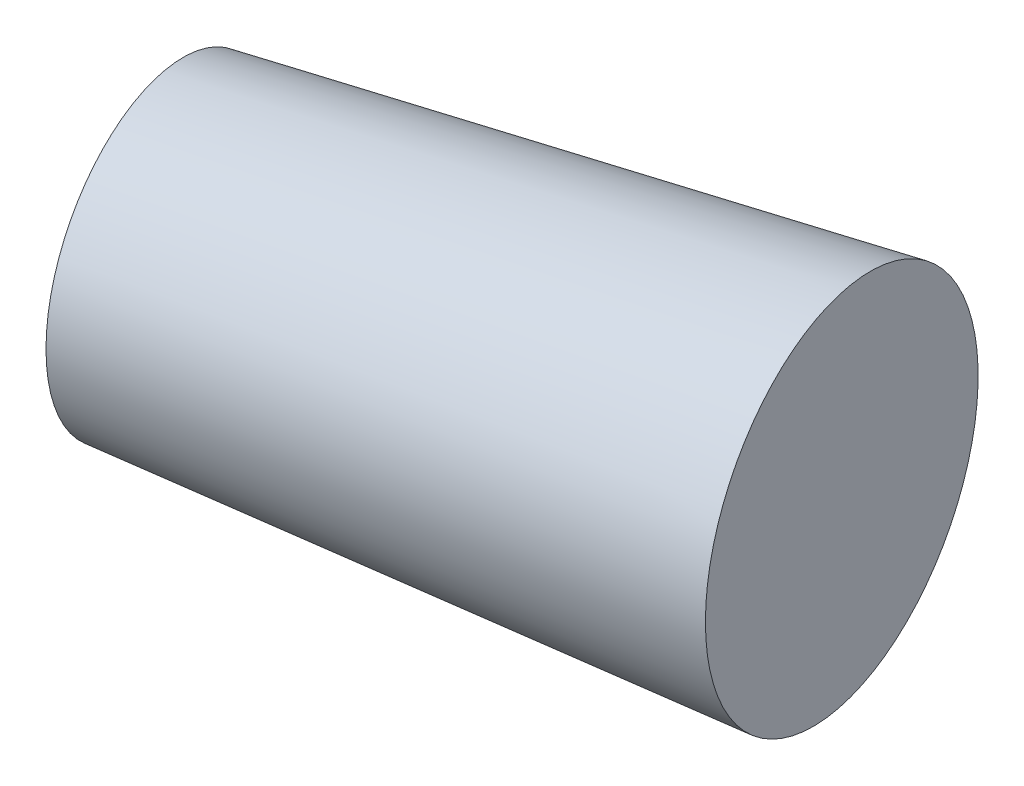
ISO-10303-21;
HEADER;
FILE_DESCRIPTION(('STEP AP214'),'2;1');
FILE_NAME('part.step','',(''),(''),'','','');
FILE_SCHEMA(('AUTOMOTIVE_DESIGN { 1 0 10303 214 1 1 1 1 }'));
ENDSEC;
DATA;
#1=APPLICATION_CONTEXT('core data for automotive mechanical design processes');
#2=APPLICATION_PROTOCOL_DEFINITION('international standard','automotive_design',2000,#1);
#3=PRODUCT_CONTEXT('',#1,'mechanical');
#4=PRODUCT('Part','Part','',(#3));
#5=PRODUCT_RELATED_PRODUCT_CATEGORY('part','',(#4));
#6=PRODUCT_DEFINITION_FORMATION('','',#4);
#7=PRODUCT_DEFINITION_CONTEXT('part definition',#1,'design');
#8=PRODUCT_DEFINITION('design','',#6,#7);
#9=PRODUCT_DEFINITION_SHAPE('','',#8);
#10=(LENGTH_UNIT() NAMED_UNIT(*) SI_UNIT(.MILLI.,.METRE.));
#11=(NAMED_UNIT(*) PLANE_ANGLE_UNIT() SI_UNIT($,.RADIAN.));
#12=(NAMED_UNIT(*) SI_UNIT($,.STERADIAN.) SOLID_ANGLE_UNIT());
#13=UNCERTAINTY_MEASURE_WITH_UNIT(LENGTH_MEASURE(1.E-05),#10,'distance_accuracy_value','');
#14=(GEOMETRIC_REPRESENTATION_CONTEXT(3) GLOBAL_UNCERTAINTY_ASSIGNED_CONTEXT((#13)) GLOBAL_UNIT_ASSIGNED_CONTEXT((#10,
#11,#12)) REPRESENTATION_CONTEXT('',''));
#15=CARTESIAN_POINT('',(0.,0.,0.));
#16=DIRECTION('',(0.,0.,1.));
#17=DIRECTION('',(1.,0.,0.));
#18=AXIS2_PLACEMENT_3D('',#15,#16,#17);
#19=CARTESIAN_POINT('',(3.75915224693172,0.,-0.824375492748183));
#20=DIRECTION('',(0.976788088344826,0.,-0.214207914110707));
#21=DIRECTION('',(-0.214207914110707,0.,-0.976788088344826));
#22=AXIS2_PLACEMENT_3D('',#19,#20,#21);
#23=CONICAL_SURFACE('',#22,2.875,0.0523598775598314);
#24=CARTESIAN_POINT('',(-5.23898989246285,0.,1.14890129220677));
#25=DIRECTION('',(-0.976788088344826,0.,0.214207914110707));
#26=DIRECTION('',(0.214207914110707,0.,0.976788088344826));
#27=AXIS2_PLACEMENT_3D('',#24,#25,#26);
#28=CIRCLE('',#27,2.39222113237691);
#29=CARTESIAN_POINT('',(-4.72655719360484,0.,3.48559439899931));
#30=VERTEX_POINT('',#29);
#31=EDGE_CURVE('E10',#30,#30,#28,.T.);
#32=ORIENTED_EDGE('',*,*,#31,.F.);
#33=EDGE_LOOP('',(#32));
#34=FACE_BOUND('',#33,.T.);
#35=CARTESIAN_POINT('',(3.75915224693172,0.,-0.824375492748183));
#36=DIRECTION('',(-0.976788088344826,0.,0.214207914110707));
#37=DIRECTION('',(0.214207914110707,0.,0.976788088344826));
#38=AXIS2_PLACEMENT_3D('',#35,#36,#37);
#39=CIRCLE('',#38,2.875);
#40=CARTESIAN_POINT('',(4.375,0.,1.9838902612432));
#41=VERTEX_POINT('',#40);
#42=EDGE_CURVE('E38',#41,#41,#39,.T.);
#43=ORIENTED_EDGE('',*,*,#42,.T.);
#44=EDGE_LOOP('',(#43));
#45=FACE_BOUND('',#44,.T.);
#46=ADVANCED_FACE('F32',(#34,#45),#23,.T.);
#47=CARTESIAN_POINT('',(-5.23898989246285,0.,1.14890129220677));
#48=DIRECTION('',(0.976788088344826,0.,-0.214207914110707));
#49=DIRECTION('',(-0.214207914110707,0.,-0.976788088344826));
#50=AXIS2_PLACEMENT_3D('',#47,#48,#49);
#51=PLANE('',#50);
#52=ORIENTED_EDGE('',*,*,#31,.T.);
#53=EDGE_LOOP('',(#52));
#54=FACE_BOUND('',#53,.T.);
#55=ADVANCED_FACE('F47',(#54),#51,.F.);
#56=CARTESIAN_POINT('',(3.75915224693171,0.,-0.824375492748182));
#57=DIRECTION('',(-0.976788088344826,0.,0.214207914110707));
#58=DIRECTION('',(0.214207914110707,0.,0.976788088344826));
#59=AXIS2_PLACEMENT_3D('',#56,#57,#58);
#60=PLANE('',#59);
#61=ORIENTED_EDGE('',*,*,#42,.F.);
#62=EDGE_LOOP('',(#61));
#63=FACE_BOUND('',#62,.T.);
#64=ADVANCED_FACE('F45',(#63),#60,.F.);
#65=CLOSED_SHELL('',(#46,#55,#64));
#66=MANIFOLD_SOLID_BREP('B2',#65);
#67=ADVANCED_BREP_SHAPE_REPRESENTATION('',(#18,#66),#14);
#68=SHAPE_DEFINITION_REPRESENTATION(#9,#67);
ENDSEC;
END-ISO-10303-21;
